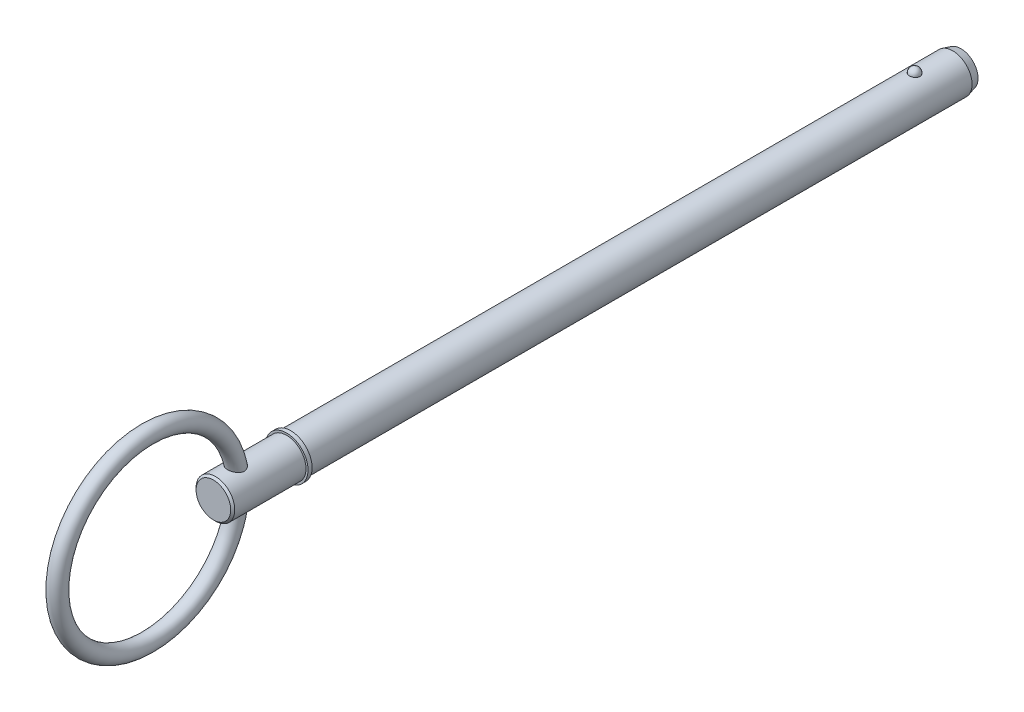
from build123d import *

# Parameters (mm, degrees)
SKETCH2_R           = 4.765
BOSS_EXTRUDE1_DEPTH = 152.4
BOSS_EXTRUDE2_START = 12.7
SKETCH3_R           = 4.765
BOSS_EXTRUDE2_DEPTH = 12.7
CHAMFER1_SIZE       = 2
CHAMFER1_SIZE2      = 0.535898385
SKETCH20_W          = 1
SKETCH20_H          = 5.265
SKETCH21_R          = 4.765
BOSS_EXTRUDE3_DEPTH = 19.05
CHAMFER2_SIZE       = 0.5
SKETCH24_R          = 2


with BuildPart() as part:
    # Sketch2 → Boss-Extrude1 (new body)
    with BuildSketch(Plane.XY):
        with Locations(Location((0, 0, 0), (0, 0, 180))):
            Circle(SKETCH2_R)
    extrude(amount=BOSS_EXTRUDE1_DEPTH)

    # Sketch3 → Boss-Extrude2 (add)
    with BuildSketch(Plane(origin=(0, 0, 0), x_dir=(-1, 0, 0), z_dir=(0, 0, -1)).offset(BOSS_EXTRUDE2_START)):
        Circle(SKETCH3_R)
    extrude(amount=-BOSS_EXTRUDE2_DEPTH)

    # Chamfer1
    chamfer1_edges = [part.edges().sort_by_distance(p)[0] for p in [
        (4.765, 0, -12.7),
    ]]
    chamfer1_side = [part.faces().sort_by_distance(p)[0] for p in [
        (4.765, 0, 69.85),
    ]]
    chamfer(chamfer1_edges, length=CHAMFER1_SIZE, length2=CHAMFER1_SIZE2, reference=chamfer1_side[0])

    # Sketch18 → Revolve1 (revolve)
    with BuildSketch(Plane(origin=(0, 0, 0), x_dir=(0, 0, -1), z_dir=(1, 0, 0))):
        with BuildLine():
            Line((1.29, 6.055), (1.29, 3.475))
            ThreePointArc((1.29, 3.475), (0, 4.765), (1.29, 6.055))
        make_face()
    revolve(axis=Axis((0, 6.055, -1.29), (0, -1, 0)))

    # Sketch20 → Revolve2 (revolve)
    with BuildSketch(Plane(origin=(0, 0, 0), x_dir=(0, 0, -1), z_dir=(1, 0, 0)), mode=Mode.PRIVATE) as revolve2_sk:
        with Locations((-152.9, 2.6325)):
            Rectangle(SKETCH20_W, SKETCH20_H)
    revolve(revolve2_sk.sketch.rotate(Axis((0, 0, 33.728787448), (0, 0, 1)), 90), axis=Axis((0, 0, 33.728787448), (0, 0, 1)))

    # Sketch21 → Boss-Extrude3 (add)
    with BuildSketch(Plane(origin=(0, 0, 152.4), x_dir=(-1, 0, 0), z_dir=(0, 0, -1))):
        Circle(SKETCH21_R)
    extrude(amount=-BOSS_EXTRUDE3_DEPTH)

    # Chamfer2
    chamfer2_edges = [part.edges().sort_by_distance(p)[0] for p in [
        (4.765, 0, 171.45),
    ]]
    chamfer(chamfer2_edges, length=CHAMFER2_SIZE)

    # Sweep1: sweep along a path in Sketch23
    with BuildLine(Plane(origin=(0, 0, 0), x_dir=(0, 0, -1), z_dir=(1, 0, 0))) as sweep1_path:
        CenterArc((-187.675, 0), 22.225, 0, 360)
    # Sketch24 → Sweep1 (sweep)
    with BuildSketch(Plane(origin=(0, 0, 0), x_dir=(1, 0, 0), z_dir=(0, 1, 0))):
        with Locations((0, -165.45)):
            Circle(SKETCH24_R)
    sweep(path=sweep1_path.line)


solid = part.part
